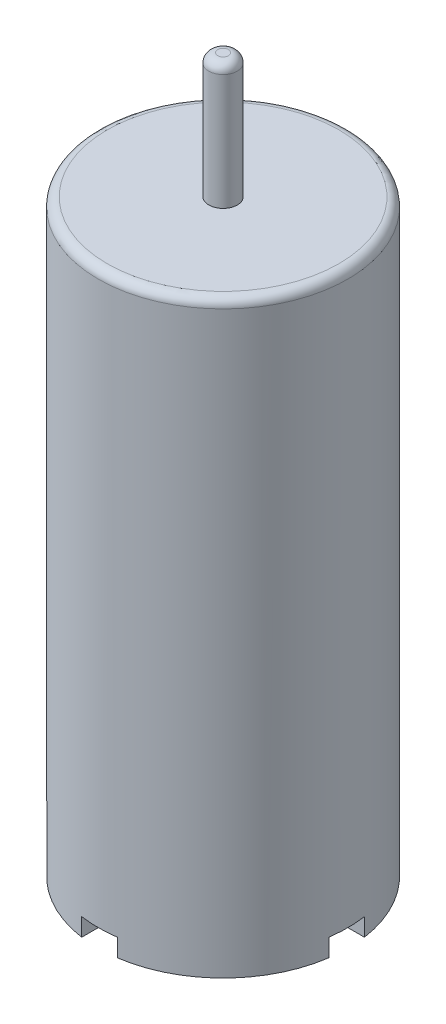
ISO-10303-21;
HEADER;
FILE_DESCRIPTION(('STEP AP214'),'2;1');
FILE_NAME('part.step','',(''),(''),'','','');
FILE_SCHEMA(('AUTOMOTIVE_DESIGN { 1 0 10303 214 1 1 1 1 }'));
ENDSEC;
DATA;
#1=APPLICATION_CONTEXT('core data for automotive mechanical design processes');
#2=APPLICATION_PROTOCOL_DEFINITION('international standard','automotive_design',2000,#1);
#3=PRODUCT_CONTEXT('',#1,'mechanical');
#4=PRODUCT('Part','Part','',(#3));
#5=PRODUCT_RELATED_PRODUCT_CATEGORY('part','',(#4));
#6=PRODUCT_DEFINITION_FORMATION('','',#4);
#7=PRODUCT_DEFINITION_CONTEXT('part definition',#1,'design');
#8=PRODUCT_DEFINITION('design','',#6,#7);
#9=PRODUCT_DEFINITION_SHAPE('','',#8);
#10=(LENGTH_UNIT() NAMED_UNIT(*) SI_UNIT(.MILLI.,.METRE.));
#11=(NAMED_UNIT(*) PLANE_ANGLE_UNIT() SI_UNIT($,.RADIAN.));
#12=(NAMED_UNIT(*) SI_UNIT($,.STERADIAN.) SOLID_ANGLE_UNIT());
#13=UNCERTAINTY_MEASURE_WITH_UNIT(LENGTH_MEASURE(1.E-05),#10,'distance_accuracy_value','');
#14=(GEOMETRIC_REPRESENTATION_CONTEXT(3) GLOBAL_UNCERTAINTY_ASSIGNED_CONTEXT((#13)) GLOBAL_UNIT_ASSIGNED_CONTEXT((#10,
#11,#12)) REPRESENTATION_CONTEXT('',''));
#15=CARTESIAN_POINT('',(0.,0.,0.));
#16=DIRECTION('',(0.,0.,1.));
#17=DIRECTION('',(1.,0.,0.));
#18=AXIS2_PLACEMENT_3D('',#15,#16,#17);
#19=CARTESIAN_POINT('',(0.,0.,0.));
#20=DIRECTION('',(0.,1.,0.));
#21=DIRECTION('',(0.,0.,1.));
#22=AXIS2_PLACEMENT_3D('',#19,#20,#21);
#23=PLANE('',#22);
#24=DIRECTION('',(0.,0.,1.));
#25=VECTOR('',#24,1.);
#26=CARTESIAN_POINT('',(-0.5,0.,2.96410161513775));
#27=LINE('',#26,#25);
#28=CARTESIAN_POINT('',(-0.5,0.,2.96410161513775));
#29=VERTEX_POINT('',#28);
#30=CARTESIAN_POINT('',(-0.5,0.,3.46410161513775));
#31=VERTEX_POINT('',#30);
#32=EDGE_CURVE('E48',#29,#31,#27,.T.);
#33=ORIENTED_EDGE('',*,*,#32,.F.);
#34=DIRECTION('',(-1.,0.,0.));
#35=VECTOR('',#34,1.);
#36=CARTESIAN_POINT('',(-0.5,0.,2.96410161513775));
#37=LINE('',#36,#35);
#38=CARTESIAN_POINT('',(0.5,0.,2.96410161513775));
#39=VERTEX_POINT('',#38);
#40=EDGE_CURVE('E52',#39,#29,#37,.T.);
#41=ORIENTED_EDGE('',*,*,#40,.F.);
#42=DIRECTION('',(0.,0.,-1.));
#43=VECTOR('',#42,1.);
#44=CARTESIAN_POINT('',(0.5,0.,2.96410161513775));
#45=LINE('',#44,#43);
#46=CARTESIAN_POINT('',(0.5,0.,3.46410161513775));
#47=VERTEX_POINT('',#46);
#48=EDGE_CURVE('E182',#47,#39,#45,.T.);
#49=ORIENTED_EDGE('',*,*,#48,.F.);
#50=CARTESIAN_POINT('',(0.,0.,0.));
#51=DIRECTION('',(0.,1.,0.));
#52=DIRECTION('',(0.,0.,1.));
#53=AXIS2_PLACEMENT_3D('',#50,#51,#52);
#54=CIRCLE('',#53,3.5);
#55=EDGE_CURVE('E167',#31,#47,#54,.T.);
#56=ORIENTED_EDGE('',*,*,#55,.F.);
#57=EDGE_LOOP('',(#33,#41,#49,#56));
#58=FACE_BOUND('',#57,.T.);
#59=ADVANCED_FACE('F33',(#58),#23,.F.);
#60=DIRECTION('',(1.,0.,0.));
#61=VECTOR('',#60,1.);
#62=CARTESIAN_POINT('',(2.96410161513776,0.,0.49999999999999));
#63=LINE('',#62,#61);
#64=CARTESIAN_POINT('',(2.96410161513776,0.,0.49999999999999));
#65=VERTEX_POINT('',#64);
#66=CARTESIAN_POINT('',(3.46410161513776,0.,0.499999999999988));
#67=VERTEX_POINT('',#66);
#68=EDGE_CURVE('E379',#65,#67,#63,.T.);
#69=ORIENTED_EDGE('',*,*,#68,.F.);
#70=DIRECTION('',(0.,0.,1.));
#71=VECTOR('',#70,1.);
#72=CARTESIAN_POINT('',(2.96410161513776,0.,0.49999999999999));
#73=LINE('',#72,#71);
#74=CARTESIAN_POINT('',(2.96410161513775,0.,-0.50000000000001));
#75=VERTEX_POINT('',#74);
#76=EDGE_CURVE('E355',#75,#65,#73,.T.);
#77=ORIENTED_EDGE('',*,*,#76,.F.);
#78=DIRECTION('',(-1.,0.,0.));
#79=VECTOR('',#78,1.);
#80=CARTESIAN_POINT('',(2.96410161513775,0.,-0.50000000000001));
#81=LINE('',#80,#79);
#82=CARTESIAN_POINT('',(3.46410161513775,0.,-0.500000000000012));
#83=VERTEX_POINT('',#82);
#84=EDGE_CURVE('E353',#83,#75,#81,.T.);
#85=ORIENTED_EDGE('',*,*,#84,.F.);
#86=EDGE_CURVE('E214',#67,#83,#54,.T.);
#87=ORIENTED_EDGE('',*,*,#86,.F.);
#88=EDGE_LOOP('',(#69,#77,#85,#87));
#89=FACE_BOUND('',#88,.T.);
#90=ADVANCED_FACE('F230',(#89),#23,.F.);
#91=DIRECTION('',(0.,0.,-1.));
#92=VECTOR('',#91,1.);
#93=CARTESIAN_POINT('',(0.49999999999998,0.,-2.96410161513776));
#94=LINE('',#93,#92);
#95=CARTESIAN_POINT('',(0.49999999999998,0.,-2.96410161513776));
#96=VERTEX_POINT('',#95);
#97=CARTESIAN_POINT('',(0.499999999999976,0.,-3.46410161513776));
#98=VERTEX_POINT('',#97);
#99=EDGE_CURVE('E338',#96,#98,#94,.T.);
#100=ORIENTED_EDGE('',*,*,#99,.F.);
#101=DIRECTION('',(1.,0.,0.));
#102=VECTOR('',#101,1.);
#103=CARTESIAN_POINT('',(0.49999999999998,0.,-2.96410161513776));
#104=LINE('',#103,#102);
#105=CARTESIAN_POINT('',(-0.500000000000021,0.,-2.96410161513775));
#106=VERTEX_POINT('',#105);
#107=EDGE_CURVE('E194',#106,#96,#104,.T.);
#108=ORIENTED_EDGE('',*,*,#107,.F.);
#109=DIRECTION('',(0.,0.,1.));
#110=VECTOR('',#109,1.);
#111=CARTESIAN_POINT('',(-0.500000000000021,0.,-2.96410161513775));
#112=LINE('',#111,#110);
#113=CARTESIAN_POINT('',(-0.500000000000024,0.,-3.46410161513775));
#114=VERTEX_POINT('',#113);
#115=EDGE_CURVE('E200',#114,#106,#112,.T.);
#116=ORIENTED_EDGE('',*,*,#115,.F.);
#117=EDGE_CURVE('E276',#98,#114,#54,.T.);
#118=ORIENTED_EDGE('',*,*,#117,.F.);
#119=EDGE_LOOP('',(#100,#108,#116,#118));
#120=FACE_BOUND('',#119,.T.);
#121=ADVANCED_FACE('F236',(#120),#23,.F.);
#122=DIRECTION('',(-1.,0.,0.));
#123=VECTOR('',#122,1.);
#124=CARTESIAN_POINT('',(-2.96410161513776,0.,-0.499999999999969));
#125=LINE('',#124,#123);
#126=CARTESIAN_POINT('',(-2.96410161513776,0.,-0.499999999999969));
#127=VERTEX_POINT('',#126);
#128=CARTESIAN_POINT('',(-3.46410161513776,0.,-0.499999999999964));
#129=VERTEX_POINT('',#128);
#130=EDGE_CURVE('E191',#127,#129,#125,.T.);
#131=ORIENTED_EDGE('',*,*,#130,.F.);
#132=DIRECTION('',(0.,0.,-1.));
#133=VECTOR('',#132,1.);
#134=CARTESIAN_POINT('',(-2.96410161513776,0.,-0.499999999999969));
#135=LINE('',#134,#133);
#136=CARTESIAN_POINT('',(-2.96410161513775,0.,0.500000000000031));
#137=VERTEX_POINT('',#136);
#138=EDGE_CURVE('E188',#137,#127,#135,.T.);
#139=ORIENTED_EDGE('',*,*,#138,.F.);
#140=DIRECTION('',(1.,0.,0.));
#141=VECTOR('',#140,1.);
#142=CARTESIAN_POINT('',(-2.96410161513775,0.,0.500000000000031));
#143=LINE('',#142,#141);
#144=CARTESIAN_POINT('',(-3.46410161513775,0.,0.500000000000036));
#145=VERTEX_POINT('',#144);
#146=EDGE_CURVE('E180',#145,#137,#143,.T.);
#147=ORIENTED_EDGE('',*,*,#146,.F.);
#148=EDGE_CURVE('E169',#129,#145,#54,.T.);
#149=ORIENTED_EDGE('',*,*,#148,.F.);
#150=EDGE_LOOP('',(#131,#139,#147,#149));
#151=FACE_BOUND('',#150,.T.);
#152=ADVANCED_FACE('F232',(#151),#23,.F.);
#153=CARTESIAN_POINT('',(0.,16.,0.));
#154=DIRECTION('',(0.,-1.,0.));
#155=DIRECTION('',(0.,0.,-1.));
#156=AXIS2_PLACEMENT_3D('',#153,#154,#155);
#157=CYLINDRICAL_SURFACE('',#156,3.5);
#158=CARTESIAN_POINT('',(0.,15.75,0.));
#159=DIRECTION('',(0.,1.,0.));
#160=DIRECTION('',(0.,0.,1.));
#161=AXIS2_PLACEMENT_3D('',#158,#159,#160);
#162=CIRCLE('',#161,3.5);
#163=CARTESIAN_POINT('',(0.,15.75,3.5));
#164=VERTEX_POINT('',#163);
#165=EDGE_CURVE('E213',#164,#164,#162,.F.);
#166=ORIENTED_EDGE('',*,*,#165,.T.);
#167=EDGE_LOOP('',(#166));
#168=FACE_BOUND('',#167,.T.);
#169=ORIENTED_EDGE('',*,*,#55,.T.);
#170=DIRECTION('',(0.,1.,0.));
#171=VECTOR('',#170,1.);
#172=CARTESIAN_POINT('',(0.5,-0.5,3.46410161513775));
#173=LINE('',#172,#171);
#174=CARTESIAN_POINT('',(0.5,-0.5,3.46410161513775));
#175=VERTEX_POINT('',#174);
#176=EDGE_CURVE('E310',#175,#47,#173,.T.);
#177=ORIENTED_EDGE('',*,*,#176,.F.);
#178=CARTESIAN_POINT('',(0.,-0.5,0.));
#179=DIRECTION('',(0.,-1.,0.));
#180=DIRECTION('',(0.,0.,-1.));
#181=AXIS2_PLACEMENT_3D('',#178,#179,#180);
#182=CIRCLE('',#181,3.5);
#183=CARTESIAN_POINT('',(3.46410161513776,-0.5,0.499999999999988));
#184=VERTEX_POINT('',#183);
#185=EDGE_CURVE('E302',#184,#175,#182,.T.);
#186=ORIENTED_EDGE('',*,*,#185,.F.);
#187=DIRECTION('',(0.,1.,0.));
#188=VECTOR('',#187,1.);
#189=CARTESIAN_POINT('',(3.46410161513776,-0.5,0.499999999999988));
#190=LINE('',#189,#188);
#191=EDGE_CURVE('E319',#184,#67,#190,.T.);
#192=ORIENTED_EDGE('',*,*,#191,.T.);
#193=ORIENTED_EDGE('',*,*,#86,.T.);
#194=DIRECTION('',(0.,1.,0.));
#195=VECTOR('',#194,1.);
#196=CARTESIAN_POINT('',(3.46410161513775,-0.5,-0.500000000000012));
#197=LINE('',#196,#195);
#198=CARTESIAN_POINT('',(3.46410161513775,-0.5,-0.500000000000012));
#199=VERTEX_POINT('',#198);
#200=EDGE_CURVE('E321',#199,#83,#197,.T.);
#201=ORIENTED_EDGE('',*,*,#200,.F.);
#202=CARTESIAN_POINT('',(0.,-0.5,0.));
#203=DIRECTION('',(0.,-1.,0.));
#204=DIRECTION('',(0.,0.,-1.));
#205=AXIS2_PLACEMENT_3D('',#202,#203,#204);
#206=CIRCLE('',#205,3.5);
#207=CARTESIAN_POINT('',(0.499999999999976,-0.5,-3.46410161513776));
#208=VERTEX_POINT('',#207);
#209=EDGE_CURVE('E294',#208,#199,#206,.T.);
#210=ORIENTED_EDGE('',*,*,#209,.F.);
#211=DIRECTION('',(0.,1.,0.));
#212=VECTOR('',#211,1.);
#213=CARTESIAN_POINT('',(0.499999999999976,-0.5,-3.46410161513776));
#214=LINE('',#213,#212);
#215=EDGE_CURVE('E324',#208,#98,#214,.T.);
#216=ORIENTED_EDGE('',*,*,#215,.T.);
#217=ORIENTED_EDGE('',*,*,#117,.T.);
#218=DIRECTION('',(0.,1.,0.));
#219=VECTOR('',#218,1.);
#220=CARTESIAN_POINT('',(-0.500000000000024,-0.5,-3.46410161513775));
#221=LINE('',#220,#219);
#222=CARTESIAN_POINT('',(-0.500000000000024,-0.5,-3.46410161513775));
#223=VERTEX_POINT('',#222);
#224=EDGE_CURVE('E207',#223,#114,#221,.T.);
#225=ORIENTED_EDGE('',*,*,#224,.F.);
#226=CARTESIAN_POINT('',(0.,-0.5,0.));
#227=DIRECTION('',(0.,-1.,0.));
#228=DIRECTION('',(0.,0.,-1.));
#229=AXIS2_PLACEMENT_3D('',#226,#227,#228);
#230=CIRCLE('',#229,3.5);
#231=CARTESIAN_POINT('',(-3.46410161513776,-0.5,-0.499999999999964));
#232=VERTEX_POINT('',#231);
#233=EDGE_CURVE('E286',#232,#223,#230,.T.);
#234=ORIENTED_EDGE('',*,*,#233,.F.);
#235=DIRECTION('',(0.,1.,0.));
#236=VECTOR('',#235,1.);
#237=CARTESIAN_POINT('',(-3.46410161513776,-0.5,-0.499999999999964));
#238=LINE('',#237,#236);
#239=EDGE_CURVE('E203',#232,#129,#238,.T.);
#240=ORIENTED_EDGE('',*,*,#239,.T.);
#241=ORIENTED_EDGE('',*,*,#148,.T.);
#242=DIRECTION('',(0.,1.,0.));
#243=VECTOR('',#242,1.);
#244=CARTESIAN_POINT('',(-3.46410161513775,-0.5,0.500000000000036));
#245=LINE('',#244,#243);
#246=CARTESIAN_POINT('',(-3.46410161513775,-0.5,0.500000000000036));
#247=VERTEX_POINT('',#246);
#248=EDGE_CURVE('E152',#247,#145,#245,.T.);
#249=ORIENTED_EDGE('',*,*,#248,.F.);
#250=CARTESIAN_POINT('',(0.,-0.5,0.));
#251=DIRECTION('',(0.,-1.,0.));
#252=DIRECTION('',(0.,0.,-1.));
#253=AXIS2_PLACEMENT_3D('',#250,#251,#252);
#254=CIRCLE('',#253,3.5);
#255=CARTESIAN_POINT('',(-0.5,-0.5,3.46410161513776));
#256=VERTEX_POINT('',#255);
#257=EDGE_CURVE('E144',#256,#247,#254,.T.);
#258=ORIENTED_EDGE('',*,*,#257,.F.);
#259=DIRECTION('',(0.,1.,0.));
#260=VECTOR('',#259,1.);
#261=CARTESIAN_POINT('',(-0.5,-0.5,3.46410161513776));
#262=LINE('',#261,#260);
#263=EDGE_CURVE('E149',#256,#31,#262,.T.);
#264=ORIENTED_EDGE('',*,*,#263,.T.);
#265=EDGE_LOOP('',(#169,#177,#186,#192,#193,#201,#210,#216,#217,#225,#234,#240,#241,#249,#258,#264));
#266=FACE_BOUND('',#265,.T.);
#267=ADVANCED_FACE('F147',(#168,#266),#157,.T.);
#268=CARTESIAN_POINT('',(0.,16.,0.));
#269=DIRECTION('',(0.,1.,0.));
#270=DIRECTION('',(0.,0.,1.));
#271=AXIS2_PLACEMENT_3D('',#268,#269,#270);
#272=PLANE('',#271);
#273=CARTESIAN_POINT('',(0.,16.,0.));
#274=DIRECTION('',(0.,1.,0.));
#275=DIRECTION('',(0.,0.,1.));
#276=AXIS2_PLACEMENT_3D('',#273,#274,#275);
#277=CIRCLE('',#276,3.25);
#278=CARTESIAN_POINT('',(0.,16.,3.25));
#279=VERTEX_POINT('',#278);
#280=EDGE_CURVE('E210',#279,#279,#277,.T.);
#281=ORIENTED_EDGE('',*,*,#280,.T.);
#282=EDGE_LOOP('',(#281));
#283=FACE_BOUND('',#282,.T.);
#284=CARTESIAN_POINT('',(0.,16.,0.));
#285=DIRECTION('',(0.,1.,0.));
#286=DIRECTION('',(0.,0.,1.));
#287=AXIS2_PLACEMENT_3D('',#284,#285,#286);
#288=CIRCLE('',#287,0.4);
#289=CARTESIAN_POINT('',(0.,16.,0.4));
#290=VERTEX_POINT('',#289);
#291=EDGE_CURVE('E181',#290,#290,#288,.T.);
#292=ORIENTED_EDGE('',*,*,#291,.F.);
#293=EDGE_LOOP('',(#292));
#294=FACE_BOUND('',#293,.T.);
#295=ADVANCED_FACE('F246',(#283,#294),#272,.T.);
#296=CARTESIAN_POINT('',(-0.5,-0.5,2.96410161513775));
#297=DIRECTION('',(-1.,0.,0.));
#298=DIRECTION('',(0.,0.,1.));
#299=AXIS2_PLACEMENT_3D('',#296,#297,#298);
#300=PLANE('',#299);
#301=ORIENTED_EDGE('',*,*,#32,.T.);
#302=ORIENTED_EDGE('',*,*,#263,.F.);
#303=DIRECTION('',(0.,0.,1.));
#304=VECTOR('',#303,1.);
#305=CARTESIAN_POINT('',(-0.5,-0.5,2.96410161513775));
#306=LINE('',#305,#304);
#307=CARTESIAN_POINT('',(-0.5,-0.5,2.96410161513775));
#308=VERTEX_POINT('',#307);
#309=EDGE_CURVE('E156',#308,#256,#306,.T.);
#310=ORIENTED_EDGE('',*,*,#309,.F.);
#311=DIRECTION('',(0.,1.,0.));
#312=VECTOR('',#311,1.);
#313=CARTESIAN_POINT('',(-0.5,-0.5,2.96410161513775));
#314=LINE('',#313,#312);
#315=EDGE_CURVE('E306',#308,#29,#314,.T.);
#316=ORIENTED_EDGE('',*,*,#315,.T.);
#317=EDGE_LOOP('',(#301,#302,#310,#316));
#318=FACE_BOUND('',#317,.T.);
#319=ADVANCED_FACE('F166',(#318),#300,.F.);
#320=CARTESIAN_POINT('',(-2.96410161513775,-0.5,0.500000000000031));
#321=DIRECTION('',(0.,0.,1.));
#322=DIRECTION('',(1.,0.,0.));
#323=AXIS2_PLACEMENT_3D('',#320,#321,#322);
#324=PLANE('',#323);
#325=ORIENTED_EDGE('',*,*,#146,.T.);
#326=DIRECTION('',(0.,1.,0.));
#327=VECTOR('',#326,1.);
#328=CARTESIAN_POINT('',(-2.96410161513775,-0.5,0.500000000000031));
#329=LINE('',#328,#327);
#330=CARTESIAN_POINT('',(-2.96410161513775,-0.5,0.500000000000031));
#331=VERTEX_POINT('',#330);
#332=EDGE_CURVE('E171',#331,#137,#329,.T.);
#333=ORIENTED_EDGE('',*,*,#332,.F.);
#334=DIRECTION('',(1.,0.,0.));
#335=VECTOR('',#334,1.);
#336=CARTESIAN_POINT('',(-2.96410161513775,-0.5,0.500000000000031));
#337=LINE('',#336,#335);
#338=EDGE_CURVE('E155',#247,#331,#337,.T.);
#339=ORIENTED_EDGE('',*,*,#338,.F.);
#340=ORIENTED_EDGE('',*,*,#248,.T.);
#341=EDGE_LOOP('',(#325,#333,#339,#340));
#342=FACE_BOUND('',#341,.T.);
#343=ADVANCED_FACE('F280',(#342),#324,.F.);
#344=CARTESIAN_POINT('',(-2.96410161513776,-0.5,-0.499999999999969));
#345=DIRECTION('',(1.,0.,0.));
#346=DIRECTION('',(0.,0.,-1.));
#347=AXIS2_PLACEMENT_3D('',#344,#345,#346);
#348=PLANE('',#347);
#349=ORIENTED_EDGE('',*,*,#138,.T.);
#350=DIRECTION('',(0.,1.,0.));
#351=VECTOR('',#350,1.);
#352=CARTESIAN_POINT('',(-2.96410161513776,-0.5,-0.499999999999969));
#353=LINE('',#352,#351);
#354=CARTESIAN_POINT('',(-2.96410161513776,-0.5,-0.499999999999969));
#355=VERTEX_POINT('',#354);
#356=EDGE_CURVE('E206',#355,#127,#353,.T.);
#357=ORIENTED_EDGE('',*,*,#356,.F.);
#358=DIRECTION('',(0.,0.,-1.));
#359=VECTOR('',#358,1.);
#360=CARTESIAN_POINT('',(-2.96410161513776,-0.5,-0.499999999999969));
#361=LINE('',#360,#359);
#362=EDGE_CURVE('E281',#331,#355,#361,.T.);
#363=ORIENTED_EDGE('',*,*,#362,.F.);
#364=ORIENTED_EDGE('',*,*,#332,.T.);
#365=EDGE_LOOP('',(#349,#357,#363,#364));
#366=FACE_BOUND('',#365,.T.);
#367=ADVANCED_FACE('F256',(#366),#348,.F.);
#368=CARTESIAN_POINT('',(-2.96410161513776,-0.5,-0.499999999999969));
#369=DIRECTION('',(0.,0.,-1.));
#370=DIRECTION('',(-1.,0.,0.));
#371=AXIS2_PLACEMENT_3D('',#368,#369,#370);
#372=PLANE('',#371);
#373=ORIENTED_EDGE('',*,*,#130,.T.);
#374=ORIENTED_EDGE('',*,*,#239,.F.);
#375=DIRECTION('',(-1.,0.,0.));
#376=VECTOR('',#375,1.);
#377=CARTESIAN_POINT('',(-2.96410161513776,-0.5,-0.499999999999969));
#378=LINE('',#377,#376);
#379=EDGE_CURVE('E261',#355,#232,#378,.T.);
#380=ORIENTED_EDGE('',*,*,#379,.F.);
#381=ORIENTED_EDGE('',*,*,#356,.T.);
#382=EDGE_LOOP('',(#373,#374,#380,#381));
#383=FACE_BOUND('',#382,.T.);
#384=ADVANCED_FACE('F260',(#383),#372,.F.);
#385=CARTESIAN_POINT('',(-0.500000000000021,-0.5,-2.96410161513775));
#386=DIRECTION('',(-1.,0.,0.));
#387=DIRECTION('',(0.,0.,1.));
#388=AXIS2_PLACEMENT_3D('',#385,#386,#387);
#389=PLANE('',#388);
#390=ORIENTED_EDGE('',*,*,#115,.T.);
#391=DIRECTION('',(0.,1.,0.));
#392=VECTOR('',#391,1.);
#393=CARTESIAN_POINT('',(-0.500000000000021,-0.5,-2.96410161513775));
#394=LINE('',#393,#392);
#395=CARTESIAN_POINT('',(-0.500000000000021,-0.5,-2.96410161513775));
#396=VERTEX_POINT('',#395);
#397=EDGE_CURVE('E265',#396,#106,#394,.T.);
#398=ORIENTED_EDGE('',*,*,#397,.F.);
#399=DIRECTION('',(0.,0.,1.));
#400=VECTOR('',#399,1.);
#401=CARTESIAN_POINT('',(-0.500000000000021,-0.5,-2.96410161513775));
#402=LINE('',#401,#400);
#403=EDGE_CURVE('E288',#223,#396,#402,.T.);
#404=ORIENTED_EDGE('',*,*,#403,.F.);
#405=ORIENTED_EDGE('',*,*,#224,.T.);
#406=EDGE_LOOP('',(#390,#398,#404,#405));
#407=FACE_BOUND('',#406,.T.);
#408=ADVANCED_FACE('F349',(#407),#389,.F.);
#409=CARTESIAN_POINT('',(0.49999999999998,-0.5,-2.96410161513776));
#410=DIRECTION('',(0.,0.,1.));
#411=DIRECTION('',(1.,0.,0.));
#412=AXIS2_PLACEMENT_3D('',#409,#410,#411);
#413=PLANE('',#412);
#414=ORIENTED_EDGE('',*,*,#107,.T.);
#415=DIRECTION('',(0.,1.,0.));
#416=VECTOR('',#415,1.);
#417=CARTESIAN_POINT('',(0.49999999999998,-0.5,-2.96410161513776));
#418=LINE('',#417,#416);
#419=CARTESIAN_POINT('',(0.49999999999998,-0.5,-2.96410161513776));
#420=VERTEX_POINT('',#419);
#421=EDGE_CURVE('E322',#420,#96,#418,.T.);
#422=ORIENTED_EDGE('',*,*,#421,.F.);
#423=DIRECTION('',(1.,0.,0.));
#424=VECTOR('',#423,1.);
#425=CARTESIAN_POINT('',(0.49999999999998,-0.5,-2.96410161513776));
#426=LINE('',#425,#424);
#427=EDGE_CURVE('E290',#396,#420,#426,.T.);
#428=ORIENTED_EDGE('',*,*,#427,.F.);
#429=ORIENTED_EDGE('',*,*,#397,.T.);
#430=EDGE_LOOP('',(#414,#422,#428,#429));
#431=FACE_BOUND('',#430,.T.);
#432=ADVANCED_FACE('F358',(#431),#413,.F.);
#433=CARTESIAN_POINT('',(0.49999999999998,-0.5,-2.96410161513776));
#434=DIRECTION('',(1.,0.,0.));
#435=DIRECTION('',(0.,0.,-1.));
#436=AXIS2_PLACEMENT_3D('',#433,#434,#435);
#437=PLANE('',#436);
#438=ORIENTED_EDGE('',*,*,#99,.T.);
#439=ORIENTED_EDGE('',*,*,#215,.F.);
#440=DIRECTION('',(0.,0.,-1.));
#441=VECTOR('',#440,1.);
#442=CARTESIAN_POINT('',(0.49999999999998,-0.5,-2.96410161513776));
#443=LINE('',#442,#441);
#444=EDGE_CURVE('E292',#420,#208,#443,.T.);
#445=ORIENTED_EDGE('',*,*,#444,.F.);
#446=ORIENTED_EDGE('',*,*,#421,.T.);
#447=EDGE_LOOP('',(#438,#439,#445,#446));
#448=FACE_BOUND('',#447,.T.);
#449=ADVANCED_FACE('F352',(#448),#437,.F.);
#450=CARTESIAN_POINT('',(2.96410161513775,-0.5,-0.50000000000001));
#451=DIRECTION('',(0.,0.,-1.));
#452=DIRECTION('',(-1.,0.,0.));
#453=AXIS2_PLACEMENT_3D('',#450,#451,#452);
#454=PLANE('',#453);
#455=ORIENTED_EDGE('',*,*,#84,.T.);
#456=DIRECTION('',(0.,1.,0.));
#457=VECTOR('',#456,1.);
#458=CARTESIAN_POINT('',(2.96410161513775,-0.5,-0.50000000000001));
#459=LINE('',#458,#457);
#460=CARTESIAN_POINT('',(2.96410161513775,-0.5,-0.50000000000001));
#461=VERTEX_POINT('',#460);
#462=EDGE_CURVE('E318',#461,#75,#459,.T.);
#463=ORIENTED_EDGE('',*,*,#462,.F.);
#464=DIRECTION('',(-1.,0.,0.));
#465=VECTOR('',#464,1.);
#466=CARTESIAN_POINT('',(2.96410161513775,-0.5,-0.50000000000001));
#467=LINE('',#466,#465);
#468=EDGE_CURVE('E296',#199,#461,#467,.T.);
#469=ORIENTED_EDGE('',*,*,#468,.F.);
#470=ORIENTED_EDGE('',*,*,#200,.T.);
#471=EDGE_LOOP('',(#455,#463,#469,#470));
#472=FACE_BOUND('',#471,.T.);
#473=ADVANCED_FACE('F366',(#472),#454,.F.);
#474=CARTESIAN_POINT('',(2.96410161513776,-0.5,0.49999999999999));
#475=DIRECTION('',(-1.,0.,0.));
#476=DIRECTION('',(0.,0.,1.));
#477=AXIS2_PLACEMENT_3D('',#474,#475,#476);
#478=PLANE('',#477);
#479=ORIENTED_EDGE('',*,*,#76,.T.);
#480=DIRECTION('',(0.,1.,0.));
#481=VECTOR('',#480,1.);
#482=CARTESIAN_POINT('',(2.96410161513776,-0.5,0.49999999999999));
#483=LINE('',#482,#481);
#484=CARTESIAN_POINT('',(2.96410161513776,-0.5,0.49999999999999));
#485=VERTEX_POINT('',#484);
#486=EDGE_CURVE('E315',#485,#65,#483,.T.);
#487=ORIENTED_EDGE('',*,*,#486,.F.);
#488=DIRECTION('',(0.,0.,1.));
#489=VECTOR('',#488,1.);
#490=CARTESIAN_POINT('',(2.96410161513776,-0.5,0.49999999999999));
#491=LINE('',#490,#489);
#492=EDGE_CURVE('E298',#461,#485,#491,.T.);
#493=ORIENTED_EDGE('',*,*,#492,.F.);
#494=ORIENTED_EDGE('',*,*,#462,.T.);
#495=EDGE_LOOP('',(#479,#487,#493,#494));
#496=FACE_BOUND('',#495,.T.);
#497=ADVANCED_FACE('F371',(#496),#478,.F.);
#498=CARTESIAN_POINT('',(2.96410161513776,-0.5,0.49999999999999));
#499=DIRECTION('',(0.,0.,1.));
#500=DIRECTION('',(1.,0.,0.));
#501=AXIS2_PLACEMENT_3D('',#498,#499,#500);
#502=PLANE('',#501);
#503=ORIENTED_EDGE('',*,*,#68,.T.);
#504=ORIENTED_EDGE('',*,*,#191,.F.);
#505=DIRECTION('',(1.,0.,0.));
#506=VECTOR('',#505,1.);
#507=CARTESIAN_POINT('',(2.96410161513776,-0.5,0.49999999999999));
#508=LINE('',#507,#506);
#509=EDGE_CURVE('E300',#485,#184,#508,.T.);
#510=ORIENTED_EDGE('',*,*,#509,.F.);
#511=ORIENTED_EDGE('',*,*,#486,.T.);
#512=EDGE_LOOP('',(#503,#504,#510,#511));
#513=FACE_BOUND('',#512,.T.);
#514=ADVANCED_FACE('F378',(#513),#502,.F.);
#515=CARTESIAN_POINT('',(0.5,-0.5,2.96410161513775));
#516=DIRECTION('',(1.,0.,0.));
#517=DIRECTION('',(0.,0.,-1.));
#518=AXIS2_PLACEMENT_3D('',#515,#516,#517);
#519=PLANE('',#518);
#520=ORIENTED_EDGE('',*,*,#48,.T.);
#521=DIRECTION('',(0.,1.,0.));
#522=VECTOR('',#521,1.);
#523=CARTESIAN_POINT('',(0.5,-0.5,2.96410161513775));
#524=LINE('',#523,#522);
#525=CARTESIAN_POINT('',(0.5,-0.5,2.96410161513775));
#526=VERTEX_POINT('',#525);
#527=EDGE_CURVE('E307',#526,#39,#524,.T.);
#528=ORIENTED_EDGE('',*,*,#527,.F.);
#529=DIRECTION('',(0.,0.,-1.));
#530=VECTOR('',#529,1.);
#531=CARTESIAN_POINT('',(0.5,-0.5,2.96410161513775));
#532=LINE('',#531,#530);
#533=EDGE_CURVE('E303',#175,#526,#532,.T.);
#534=ORIENTED_EDGE('',*,*,#533,.F.);
#535=ORIENTED_EDGE('',*,*,#176,.T.);
#536=EDGE_LOOP('',(#520,#528,#534,#535));
#537=FACE_BOUND('',#536,.T.);
#538=ADVANCED_FACE('F384',(#537),#519,.F.);
#539=CARTESIAN_POINT('',(-0.5,-0.5,2.96410161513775));
#540=DIRECTION('',(0.,0.,-1.));
#541=DIRECTION('',(-1.,0.,0.));
#542=AXIS2_PLACEMENT_3D('',#539,#540,#541);
#543=PLANE('',#542);
#544=ORIENTED_EDGE('',*,*,#40,.T.);
#545=ORIENTED_EDGE('',*,*,#315,.F.);
#546=DIRECTION('',(-1.,0.,0.));
#547=VECTOR('',#546,1.);
#548=CARTESIAN_POINT('',(-0.5,-0.5,2.96410161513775));
#549=LINE('',#548,#547);
#550=EDGE_CURVE('E161',#526,#308,#549,.T.);
#551=ORIENTED_EDGE('',*,*,#550,.F.);
#552=ORIENTED_EDGE('',*,*,#527,.T.);
#553=EDGE_LOOP('',(#544,#545,#551,#552));
#554=FACE_BOUND('',#553,.T.);
#555=ADVANCED_FACE('F386',(#554),#543,.F.);
#556=CARTESIAN_POINT('',(0.,-0.5,0.));
#557=DIRECTION('',(0.,-1.,0.));
#558=DIRECTION('',(0.,0.,-1.));
#559=AXIS2_PLACEMENT_3D('',#556,#557,#558);
#560=PLANE('',#559);
#561=ORIENTED_EDGE('',*,*,#309,.T.);
#562=ORIENTED_EDGE('',*,*,#257,.T.);
#563=ORIENTED_EDGE('',*,*,#338,.T.);
#564=ORIENTED_EDGE('',*,*,#362,.T.);
#565=ORIENTED_EDGE('',*,*,#379,.T.);
#566=ORIENTED_EDGE('',*,*,#233,.T.);
#567=ORIENTED_EDGE('',*,*,#403,.T.);
#568=ORIENTED_EDGE('',*,*,#427,.T.);
#569=ORIENTED_EDGE('',*,*,#444,.T.);
#570=ORIENTED_EDGE('',*,*,#209,.T.);
#571=ORIENTED_EDGE('',*,*,#468,.T.);
#572=ORIENTED_EDGE('',*,*,#492,.T.);
#573=ORIENTED_EDGE('',*,*,#509,.T.);
#574=ORIENTED_EDGE('',*,*,#185,.T.);
#575=ORIENTED_EDGE('',*,*,#533,.T.);
#576=ORIENTED_EDGE('',*,*,#550,.T.);
#577=EDGE_LOOP('',(#561,#562,#563,#564,#565,#566,#567,#568,#569,#570,#571,#572,#573,#574,#575,#576));
#578=FACE_BOUND('',#577,.T.);
#579=ADVANCED_FACE('F159',(#578),#560,.T.);
#580=CARTESIAN_POINT('',(0.,19.5,0.));
#581=DIRECTION('',(0.,-1.,0.));
#582=DIRECTION('',(0.,0.,-1.));
#583=AXIS2_PLACEMENT_3D('',#580,#581,#582);
#584=CYLINDRICAL_SURFACE('',#583,0.4);
#585=CARTESIAN_POINT('',(0.,19.25,0.));
#586=DIRECTION('',(0.,1.,0.));
#587=DIRECTION('',(0.,0.,1.));
#588=AXIS2_PLACEMENT_3D('',#585,#586,#587);
#589=CIRCLE('',#588,0.4);
#590=CARTESIAN_POINT('',(0.,19.25,0.4));
#591=VERTEX_POINT('',#590);
#592=EDGE_CURVE('E11',#591,#591,#589,.F.);
#593=ORIENTED_EDGE('',*,*,#592,.T.);
#594=EDGE_LOOP('',(#593));
#595=FACE_BOUND('',#594,.T.);
#596=ORIENTED_EDGE('',*,*,#291,.T.);
#597=EDGE_LOOP('',(#596));
#598=FACE_BOUND('',#597,.T.);
#599=ADVANCED_FACE('F405',(#595,#598),#584,.T.);
#600=CARTESIAN_POINT('',(0.,19.5,0.));
#601=DIRECTION('',(0.,1.,0.));
#602=DIRECTION('',(0.,0.,1.));
#603=AXIS2_PLACEMENT_3D('',#600,#601,#602);
#604=PLANE('',#603);
#605=CARTESIAN_POINT('',(0.,19.5,0.));
#606=DIRECTION('',(0.,1.,0.));
#607=DIRECTION('',(0.,0.,1.));
#608=AXIS2_PLACEMENT_3D('',#605,#606,#607);
#609=CIRCLE('',#608,0.15);
#610=CARTESIAN_POINT('',(0.,19.5,0.15));
#611=VERTEX_POINT('',#610);
#612=EDGE_CURVE('E41',#611,#611,#609,.T.);
#613=ORIENTED_EDGE('',*,*,#612,.T.);
#614=EDGE_LOOP('',(#613));
#615=FACE_BOUND('',#614,.T.);
#616=ADVANCED_FACE('F219',(#615),#604,.T.);
#617=CARTESIAN_POINT('',(0.,15.75,0.));
#618=DIRECTION('',(0.,1.,0.));
#619=DIRECTION('',(0.,0.,1.));
#620=AXIS2_PLACEMENT_3D('',#617,#618,#619);
#621=TOROIDAL_SURFACE('',#620,3.25,0.25);
#622=ORIENTED_EDGE('',*,*,#165,.F.);
#623=EDGE_LOOP('',(#622));
#624=FACE_BOUND('',#623,.T.);
#625=ORIENTED_EDGE('',*,*,#280,.F.);
#626=EDGE_LOOP('',(#625));
#627=FACE_BOUND('',#626,.T.);
#628=ADVANCED_FACE('F222',(#624,#627),#621,.T.);
#629=CARTESIAN_POINT('',(0.,19.25,0.));
#630=DIRECTION('',(0.,1.,0.));
#631=DIRECTION('',(0.,0.,1.));
#632=AXIS2_PLACEMENT_3D('',#629,#630,#631);
#633=DEGENERATE_TOROIDAL_SURFACE('',#632,0.15,0.25,.T.);
#634=ORIENTED_EDGE('',*,*,#592,.F.);
#635=EDGE_LOOP('',(#634));
#636=FACE_BOUND('',#635,.T.);
#637=ORIENTED_EDGE('',*,*,#612,.F.);
#638=EDGE_LOOP('',(#637));
#639=FACE_BOUND('',#638,.T.);
#640=ADVANCED_FACE('F35',(#636,#639),#633,.T.);
#641=CLOSED_SHELL('',(#59,#90,#121,#152,#267,#295,#319,#343,#367,#384,#408,#432,#449,#473,#497,
#514,#538,#555,#579,#599,#616,#628,#640));
#642=MANIFOLD_SOLID_BREP('B2',#641);
#643=ADVANCED_BREP_SHAPE_REPRESENTATION('',(#18,#642),#14);
#644=SHAPE_DEFINITION_REPRESENTATION(#9,#643);
ENDSEC;
END-ISO-10303-21;
